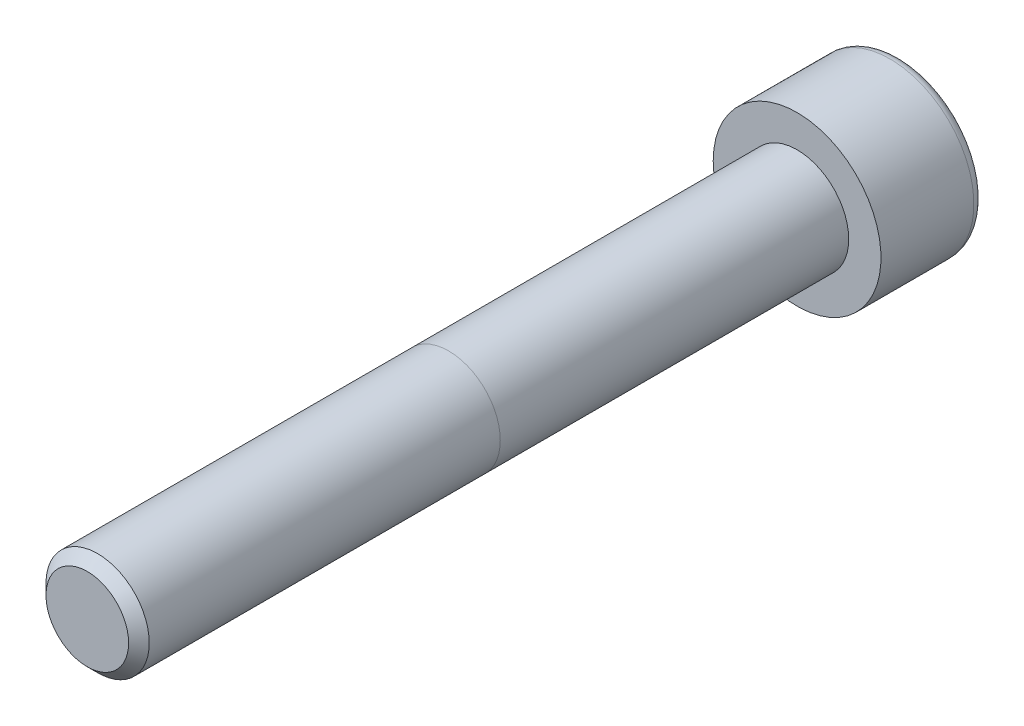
ISO-10303-21;
HEADER;
FILE_DESCRIPTION(('STEP AP214'),'2;1');
FILE_NAME('part.step','',(''),(''),'','','');
FILE_SCHEMA(('AUTOMOTIVE_DESIGN { 1 0 10303 214 1 1 1 1 }'));
ENDSEC;
DATA;
#1=APPLICATION_CONTEXT('core data for automotive mechanical design processes');
#2=APPLICATION_PROTOCOL_DEFINITION('international standard','automotive_design',2000,#1);
#3=PRODUCT_CONTEXT('',#1,'mechanical');
#4=PRODUCT('Part','Part','',(#3));
#5=PRODUCT_RELATED_PRODUCT_CATEGORY('part','',(#4));
#6=PRODUCT_DEFINITION_FORMATION('','',#4);
#7=PRODUCT_DEFINITION_CONTEXT('part definition',#1,'design');
#8=PRODUCT_DEFINITION('design','',#6,#7);
#9=PRODUCT_DEFINITION_SHAPE('','',#8);
#10=(LENGTH_UNIT() NAMED_UNIT(*) SI_UNIT(.MILLI.,.METRE.));
#11=(NAMED_UNIT(*) PLANE_ANGLE_UNIT() SI_UNIT($,.RADIAN.));
#12=(NAMED_UNIT(*) SI_UNIT($,.STERADIAN.) SOLID_ANGLE_UNIT());
#13=UNCERTAINTY_MEASURE_WITH_UNIT(LENGTH_MEASURE(1.E-05),#10,'distance_accuracy_value','');
#14=(GEOMETRIC_REPRESENTATION_CONTEXT(3) GLOBAL_UNCERTAINTY_ASSIGNED_CONTEXT((#13)) GLOBAL_UNIT_ASSIGNED_CONTEXT((#10,
#11,#12)) REPRESENTATION_CONTEXT('',''));
#15=CARTESIAN_POINT('',(0.,0.,0.));
#16=DIRECTION('',(0.,0.,1.));
#17=DIRECTION('',(1.,0.,0.));
#18=AXIS2_PLACEMENT_3D('',#15,#16,#17);
#19=CARTESIAN_POINT('',(0.,0.,0.));
#20=DIRECTION('',(0.,0.,1.));
#21=DIRECTION('',(1.,0.,0.));
#22=AXIS2_PLACEMENT_3D('',#19,#20,#21);
#23=CYLINDRICAL_SURFACE('',#22,4.);
#24=CARTESIAN_POINT('',(0.,0.,54.2));
#25=DIRECTION('',(0.,0.,1.));
#26=DIRECTION('',(1.,0.,0.));
#27=AXIS2_PLACEMENT_3D('',#24,#25,#26);
#28=CIRCLE('',#27,4.);
#29=CARTESIAN_POINT('',(4.00000000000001,0.,54.2));
#30=VERTEX_POINT('',#29);
#31=EDGE_CURVE('E44',#30,#30,#28,.F.);
#32=ORIENTED_EDGE('',*,*,#31,.T.);
#33=EDGE_LOOP('',(#32));
#34=FACE_BOUND('',#33,.T.);
#35=CARTESIAN_POINT('',(0.,0.,27.));
#36=DIRECTION('',(0.,0.,-1.));
#37=DIRECTION('',(-1.,0.,0.));
#38=AXIS2_PLACEMENT_3D('',#35,#36,#37);
#39=CIRCLE('',#38,4.);
#40=CARTESIAN_POINT('',(-4.,0.,27.));
#41=VERTEX_POINT('',#40);
#42=EDGE_CURVE('E11',#41,#41,#39,.F.);
#43=ORIENTED_EDGE('',*,*,#42,.T.);
#44=EDGE_LOOP('',(#43));
#45=FACE_BOUND('',#44,.T.);
#46=ADVANCED_FACE('F35',(#34,#45),#23,.T.);
#47=CARTESIAN_POINT('',(0.,0.,-8.));
#48=DIRECTION('',(0.,0.,1.));
#49=DIRECTION('',(1.,0.,0.));
#50=AXIS2_PLACEMENT_3D('',#47,#48,#49);
#51=PLANE('',#50);
#52=CARTESIAN_POINT('',(0.,0.,-8.));
#53=DIRECTION('',(0.,0.,-1.));
#54=DIRECTION('',(-1.,0.,0.));
#55=AXIS2_PLACEMENT_3D('',#52,#53,#54);
#56=CIRCLE('',#55,5.7);
#57=CARTESIAN_POINT('',(-5.7,0.,-8.));
#58=VERTEX_POINT('',#57);
#59=EDGE_CURVE('E147',#58,#58,#56,.T.);
#60=ORIENTED_EDGE('',*,*,#59,.T.);
#61=EDGE_LOOP('',(#60));
#62=FACE_BOUND('',#61,.T.);
#63=DIRECTION('',(-0.86602540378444,0.499999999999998,0.));
#64=VECTOR('',#63,1.);
#65=CARTESIAN_POINT('',(0.,3.46410161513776,-8.));
#66=LINE('',#65,#64);
#67=CARTESIAN_POINT('',(3.,1.73205080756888,-8.));
#68=VERTEX_POINT('',#67);
#69=CARTESIAN_POINT('',(0.,3.46410161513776,-8.));
#70=VERTEX_POINT('',#69);
#71=EDGE_CURVE('E51',#68,#70,#66,.T.);
#72=ORIENTED_EDGE('',*,*,#71,.T.);
#73=DIRECTION('',(-0.866025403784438,-0.500000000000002,0.));
#74=VECTOR('',#73,1.);
#75=CARTESIAN_POINT('',(0.,3.46410161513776,-8.));
#76=LINE('',#75,#74);
#77=CARTESIAN_POINT('',(-3.,1.73205080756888,-8.));
#78=VERTEX_POINT('',#77);
#79=EDGE_CURVE('E91',#70,#78,#76,.T.);
#80=ORIENTED_EDGE('',*,*,#79,.T.);
#81=DIRECTION('',(0.,-1.,0.));
#82=VECTOR('',#81,1.);
#83=CARTESIAN_POINT('',(-3.,-1.73205080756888,-8.));
#84=LINE('',#83,#82);
#85=CARTESIAN_POINT('',(-3.,-1.73205080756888,-8.));
#86=VERTEX_POINT('',#85);
#87=EDGE_CURVE('E99',#78,#86,#84,.T.);
#88=ORIENTED_EDGE('',*,*,#87,.T.);
#89=DIRECTION('',(0.866025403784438,-0.500000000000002,0.));
#90=VECTOR('',#89,1.);
#91=CARTESIAN_POINT('',(0.,-3.46410161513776,-8.));
#92=LINE('',#91,#90);
#93=CARTESIAN_POINT('',(0.,-3.46410161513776,-8.));
#94=VERTEX_POINT('',#93);
#95=EDGE_CURVE('E117',#86,#94,#92,.T.);
#96=ORIENTED_EDGE('',*,*,#95,.T.);
#97=DIRECTION('',(0.86602540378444,0.499999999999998,0.));
#98=VECTOR('',#97,1.);
#99=CARTESIAN_POINT('',(0.,-3.46410161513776,-8.));
#100=LINE('',#99,#98);
#101=CARTESIAN_POINT('',(3.,-1.73205080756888,-8.));
#102=VERTEX_POINT('',#101);
#103=EDGE_CURVE('E120',#94,#102,#100,.T.);
#104=ORIENTED_EDGE('',*,*,#103,.T.);
#105=DIRECTION('',(0.,1.,0.));
#106=VECTOR('',#105,1.);
#107=CARTESIAN_POINT('',(3.,-1.73205080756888,-8.));
#108=LINE('',#107,#106);
#109=EDGE_CURVE('E110',#102,#68,#108,.T.);
#110=ORIENTED_EDGE('',*,*,#109,.T.);
#111=EDGE_LOOP('',(#72,#80,#88,#96,#104,#110));
#112=FACE_BOUND('',#111,.T.);
#113=ADVANCED_FACE('F37',(#62,#112),#51,.F.);
#114=CARTESIAN_POINT('',(0.,0.,-7.2));
#115=DIRECTION('',(0.,0.,-1.));
#116=DIRECTION('',(-1.,0.,0.));
#117=AXIS2_PLACEMENT_3D('',#114,#115,#116);
#118=TOROIDAL_SURFACE('',#117,5.7,0.8);
#119=ORIENTED_EDGE('',*,*,#59,.F.);
#120=EDGE_LOOP('',(#119));
#121=FACE_BOUND('',#120,.T.);
#122=CARTESIAN_POINT('',(0.,0.,-7.2));
#123=DIRECTION('',(0.,0.,-1.));
#124=DIRECTION('',(-1.,0.,0.));
#125=AXIS2_PLACEMENT_3D('',#122,#123,#124);
#126=CIRCLE('',#125,6.5);
#127=CARTESIAN_POINT('',(-6.5,0.,-7.2));
#128=VERTEX_POINT('',#127);
#129=EDGE_CURVE('E144',#128,#128,#126,.T.);
#130=ORIENTED_EDGE('',*,*,#129,.T.);
#131=EDGE_LOOP('',(#130));
#132=FACE_BOUND('',#131,.T.);
#133=ADVANCED_FACE('F181',(#121,#132),#118,.T.);
#134=CARTESIAN_POINT('',(0.,0.,0.));
#135=DIRECTION('',(0.,0.,-1.));
#136=DIRECTION('',(-1.,0.,0.));
#137=AXIS2_PLACEMENT_3D('',#134,#135,#136);
#138=CYLINDRICAL_SURFACE('',#137,6.5);
#139=ORIENTED_EDGE('',*,*,#129,.F.);
#140=EDGE_LOOP('',(#139));
#141=FACE_BOUND('',#140,.T.);
#142=CARTESIAN_POINT('',(0.,0.,0.));
#143=DIRECTION('',(0.,0.,-1.));
#144=DIRECTION('',(-1.,0.,0.));
#145=AXIS2_PLACEMENT_3D('',#142,#143,#144);
#146=CIRCLE('',#145,6.5);
#147=CARTESIAN_POINT('',(-6.5,0.,0.));
#148=VERTEX_POINT('',#147);
#149=EDGE_CURVE('E105',#148,#148,#146,.T.);
#150=ORIENTED_EDGE('',*,*,#149,.T.);
#151=EDGE_LOOP('',(#150));
#152=FACE_BOUND('',#151,.T.);
#153=ADVANCED_FACE('F186',(#141,#152),#138,.T.);
#154=CARTESIAN_POINT('',(0.,0.,0.));
#155=DIRECTION('',(0.,0.,-1.));
#156=DIRECTION('',(-1.,0.,0.));
#157=AXIS2_PLACEMENT_3D('',#154,#155,#156);
#158=PLANE('',#157);
#159=CARTESIAN_POINT('',(0.,0.,0.));
#160=DIRECTION('',(0.,0.,1.));
#161=DIRECTION('',(1.,0.,0.));
#162=AXIS2_PLACEMENT_3D('',#159,#160,#161);
#163=CIRCLE('',#162,4.);
#164=CARTESIAN_POINT('',(4.,0.,0.));
#165=VERTEX_POINT('',#164);
#166=EDGE_CURVE('E111',#165,#165,#163,.T.);
#167=ORIENTED_EDGE('',*,*,#166,.F.);
#168=EDGE_LOOP('',(#167));
#169=FACE_BOUND('',#168,.T.);
#170=ORIENTED_EDGE('',*,*,#149,.F.);
#171=EDGE_LOOP('',(#170));
#172=FACE_BOUND('',#171,.T.);
#173=ADVANCED_FACE('F194',(#169,#172),#158,.F.);
#174=CARTESIAN_POINT('',(0.,3.46410161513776,-4.));
#175=DIRECTION('',(-0.499999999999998,-0.86602540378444,0.));
#176=DIRECTION('',(0.86602540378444,-0.499999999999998,0.));
#177=AXIS2_PLACEMENT_3D('',#174,#175,#176);
#178=PLANE('',#177);
#179=ORIENTED_EDGE('',*,*,#71,.F.);
#180=DIRECTION('',(0.,0.,-1.));
#181=VECTOR('',#180,1.);
#182=CARTESIAN_POINT('',(3.,1.73205080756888,-4.));
#183=LINE('',#182,#181);
#184=CARTESIAN_POINT('',(3.,1.73205080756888,-4.));
#185=VERTEX_POINT('',#184);
#186=EDGE_CURVE('E133',#185,#68,#183,.T.);
#187=ORIENTED_EDGE('',*,*,#186,.F.);
#188=DIRECTION('',(-0.86602540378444,0.499999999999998,0.));
#189=VECTOR('',#188,1.);
#190=CARTESIAN_POINT('',(0.,3.46410161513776,-4.));
#191=LINE('',#190,#189);
#192=CARTESIAN_POINT('',(0.,3.46410161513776,-4.));
#193=VERTEX_POINT('',#192);
#194=EDGE_CURVE('E104',#185,#193,#191,.T.);
#195=ORIENTED_EDGE('',*,*,#194,.T.);
#196=DIRECTION('',(0.,0.,-1.));
#197=VECTOR('',#196,1.);
#198=CARTESIAN_POINT('',(0.,3.46410161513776,-4.));
#199=LINE('',#198,#197);
#200=EDGE_CURVE('E93',#193,#70,#199,.T.);
#201=ORIENTED_EDGE('',*,*,#200,.T.);
#202=EDGE_LOOP('',(#179,#187,#195,#201));
#203=FACE_BOUND('',#202,.T.);
#204=ADVANCED_FACE('F102',(#203),#178,.T.);
#205=CARTESIAN_POINT('',(0.,3.46410161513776,-4.));
#206=DIRECTION('',(0.500000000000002,-0.866025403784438,0.));
#207=DIRECTION('',(0.866025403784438,0.500000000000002,0.));
#208=AXIS2_PLACEMENT_3D('',#205,#206,#207);
#209=PLANE('',#208);
#210=ORIENTED_EDGE('',*,*,#79,.F.);
#211=ORIENTED_EDGE('',*,*,#200,.F.);
#212=DIRECTION('',(-0.866025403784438,-0.500000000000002,0.));
#213=VECTOR('',#212,1.);
#214=CARTESIAN_POINT('',(0.,3.46410161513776,-4.));
#215=LINE('',#214,#213);
#216=CARTESIAN_POINT('',(-3.,1.73205080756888,-4.));
#217=VERTEX_POINT('',#216);
#218=EDGE_CURVE('E124',#193,#217,#215,.T.);
#219=ORIENTED_EDGE('',*,*,#218,.T.);
#220=DIRECTION('',(0.,0.,-1.));
#221=VECTOR('',#220,1.);
#222=CARTESIAN_POINT('',(-3.,1.73205080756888,-4.));
#223=LINE('',#222,#221);
#224=EDGE_CURVE('E95',#217,#78,#223,.T.);
#225=ORIENTED_EDGE('',*,*,#224,.T.);
#226=EDGE_LOOP('',(#210,#211,#219,#225));
#227=FACE_BOUND('',#226,.T.);
#228=ADVANCED_FACE('F92',(#227),#209,.T.);
#229=CARTESIAN_POINT('',(-3.,-1.73205080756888,-4.));
#230=DIRECTION('',(1.,0.,0.));
#231=DIRECTION('',(0.,0.,-1.));
#232=AXIS2_PLACEMENT_3D('',#229,#230,#231);
#233=PLANE('',#232);
#234=ORIENTED_EDGE('',*,*,#87,.F.);
#235=ORIENTED_EDGE('',*,*,#224,.F.);
#236=DIRECTION('',(0.,-1.,0.));
#237=VECTOR('',#236,1.);
#238=CARTESIAN_POINT('',(-3.,-1.73205080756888,-4.));
#239=LINE('',#238,#237);
#240=CARTESIAN_POINT('',(-3.,-1.73205080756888,-4.));
#241=VERTEX_POINT('',#240);
#242=EDGE_CURVE('E126',#217,#241,#239,.T.);
#243=ORIENTED_EDGE('',*,*,#242,.T.);
#244=DIRECTION('',(0.,0.,-1.));
#245=VECTOR('',#244,1.);
#246=CARTESIAN_POINT('',(-3.,-1.73205080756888,-4.));
#247=LINE('',#246,#245);
#248=EDGE_CURVE('E139',#241,#86,#247,.T.);
#249=ORIENTED_EDGE('',*,*,#248,.T.);
#250=EDGE_LOOP('',(#234,#235,#243,#249));
#251=FACE_BOUND('',#250,.T.);
#252=ADVANCED_FACE('F209',(#251),#233,.T.);
#253=CARTESIAN_POINT('',(0.,-3.46410161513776,-4.));
#254=DIRECTION('',(0.500000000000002,0.866025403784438,0.));
#255=DIRECTION('',(-0.866025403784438,0.500000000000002,0.));
#256=AXIS2_PLACEMENT_3D('',#253,#254,#255);
#257=PLANE('',#256);
#258=ORIENTED_EDGE('',*,*,#95,.F.);
#259=ORIENTED_EDGE('',*,*,#248,.F.);
#260=DIRECTION('',(0.866025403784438,-0.500000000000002,0.));
#261=VECTOR('',#260,1.);
#262=CARTESIAN_POINT('',(0.,-3.46410161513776,-4.));
#263=LINE('',#262,#261);
#264=CARTESIAN_POINT('',(0.,-3.46410161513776,-4.));
#265=VERTEX_POINT('',#264);
#266=EDGE_CURVE('E128',#241,#265,#263,.T.);
#267=ORIENTED_EDGE('',*,*,#266,.T.);
#268=DIRECTION('',(0.,0.,-1.));
#269=VECTOR('',#268,1.);
#270=CARTESIAN_POINT('',(0.,-3.46410161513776,-4.));
#271=LINE('',#270,#269);
#272=EDGE_CURVE('E137',#265,#94,#271,.T.);
#273=ORIENTED_EDGE('',*,*,#272,.T.);
#274=EDGE_LOOP('',(#258,#259,#267,#273));
#275=FACE_BOUND('',#274,.T.);
#276=ADVANCED_FACE('F212',(#275),#257,.T.);
#277=CARTESIAN_POINT('',(0.,-3.46410161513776,-4.));
#278=DIRECTION('',(-0.499999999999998,0.86602540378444,0.));
#279=DIRECTION('',(-0.86602540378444,-0.499999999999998,0.));
#280=AXIS2_PLACEMENT_3D('',#277,#278,#279);
#281=PLANE('',#280);
#282=ORIENTED_EDGE('',*,*,#103,.F.);
#283=ORIENTED_EDGE('',*,*,#272,.F.);
#284=DIRECTION('',(0.86602540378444,0.499999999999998,0.));
#285=VECTOR('',#284,1.);
#286=CARTESIAN_POINT('',(0.,-3.46410161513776,-4.));
#287=LINE('',#286,#285);
#288=CARTESIAN_POINT('',(3.,-1.73205080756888,-4.));
#289=VERTEX_POINT('',#288);
#290=EDGE_CURVE('E130',#265,#289,#287,.T.);
#291=ORIENTED_EDGE('',*,*,#290,.T.);
#292=DIRECTION('',(0.,0.,-1.));
#293=VECTOR('',#292,1.);
#294=CARTESIAN_POINT('',(3.,-1.73205080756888,-4.));
#295=LINE('',#294,#293);
#296=EDGE_CURVE('E135',#289,#102,#295,.T.);
#297=ORIENTED_EDGE('',*,*,#296,.T.);
#298=EDGE_LOOP('',(#282,#283,#291,#297));
#299=FACE_BOUND('',#298,.T.);
#300=ADVANCED_FACE('F216',(#299),#281,.T.);
#301=CARTESIAN_POINT('',(3.,-1.73205080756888,-4.));
#302=DIRECTION('',(-1.,0.,0.));
#303=DIRECTION('',(0.,-1.,0.));
#304=AXIS2_PLACEMENT_3D('',#301,#302,#303);
#305=PLANE('',#304);
#306=ORIENTED_EDGE('',*,*,#109,.F.);
#307=ORIENTED_EDGE('',*,*,#296,.F.);
#308=DIRECTION('',(0.,1.,0.));
#309=VECTOR('',#308,1.);
#310=CARTESIAN_POINT('',(3.,-1.73205080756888,-4.));
#311=LINE('',#310,#309);
#312=EDGE_CURVE('E58',#289,#185,#311,.T.);
#313=ORIENTED_EDGE('',*,*,#312,.T.);
#314=ORIENTED_EDGE('',*,*,#186,.T.);
#315=EDGE_LOOP('',(#306,#307,#313,#314));
#316=FACE_BOUND('',#315,.T.);
#317=ADVANCED_FACE('F174',(#316),#305,.T.);
#318=CARTESIAN_POINT('',(-3.,5.19615242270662,-4.));
#319=DIRECTION('',(0.,0.,1.));
#320=DIRECTION('',(1.,0.,0.));
#321=AXIS2_PLACEMENT_3D('',#318,#319,#320);
#322=PLANE('',#321);
#323=ORIENTED_EDGE('',*,*,#194,.F.);
#324=ORIENTED_EDGE('',*,*,#312,.F.);
#325=ORIENTED_EDGE('',*,*,#290,.F.);
#326=ORIENTED_EDGE('',*,*,#266,.F.);
#327=ORIENTED_EDGE('',*,*,#242,.F.);
#328=ORIENTED_EDGE('',*,*,#218,.F.);
#329=EDGE_LOOP('',(#323,#324,#325,#326,#327,#328));
#330=FACE_BOUND('',#329,.T.);
#331=ADVANCED_FACE('F166',(#330),#322,.F.);
#332=CARTESIAN_POINT('',(0.,0.,55.));
#333=DIRECTION('',(0.,0.,1.));
#334=DIRECTION('',(1.,0.,0.));
#335=AXIS2_PLACEMENT_3D('',#332,#333,#334);
#336=PLANE('',#335);
#337=CARTESIAN_POINT('',(0.,0.,55.));
#338=DIRECTION('',(0.,0.,1.));
#339=DIRECTION('',(1.,0.,0.));
#340=AXIS2_PLACEMENT_3D('',#337,#338,#339);
#341=CIRCLE('',#340,3.2);
#342=CARTESIAN_POINT('',(3.20000000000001,0.,55.));
#343=VERTEX_POINT('',#342);
#344=EDGE_CURVE('E150',#343,#343,#341,.T.);
#345=ORIENTED_EDGE('',*,*,#344,.T.);
#346=EDGE_LOOP('',(#345));
#347=FACE_BOUND('',#346,.T.);
#348=ADVANCED_FACE('F164',(#347),#336,.T.);
#349=ORIENTED_EDGE('',*,*,#42,.F.);
#350=EDGE_LOOP('',(#349));
#351=FACE_BOUND('',#350,.T.);
#352=ORIENTED_EDGE('',*,*,#166,.T.);
#353=EDGE_LOOP('',(#352));
#354=FACE_BOUND('',#353,.T.);
#355=ADVANCED_FACE('F160',(#351,#354),#23,.T.);
#356=CARTESIAN_POINT('',(0.,0.,55.));
#357=DIRECTION('',(0.,0.,-1.));
#358=DIRECTION('',(-1.,0.,0.));
#359=AXIS2_PLACEMENT_3D('',#356,#357,#358);
#360=CONICAL_SURFACE('',#359,3.2,0.78539816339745);
#361=ORIENTED_EDGE('',*,*,#31,.F.);
#362=EDGE_LOOP('',(#361));
#363=FACE_BOUND('',#362,.T.);
#364=ORIENTED_EDGE('',*,*,#344,.F.);
#365=EDGE_LOOP('',(#364));
#366=FACE_BOUND('',#365,.T.);
#367=ADVANCED_FACE('F157',(#363,#366),#360,.T.);
#368=CLOSED_SHELL('',(#46,#113,#133,#153,#173,#204,#228,#252,#276,#300,#317,#331,#348,#355,#367));
#369=MANIFOLD_SOLID_BREP('B2',#368);
#370=ADVANCED_BREP_SHAPE_REPRESENTATION('',(#18,#369),#14);
#371=SHAPE_DEFINITION_REPRESENTATION(#9,#370);
ENDSEC;
END-ISO-10303-21;
